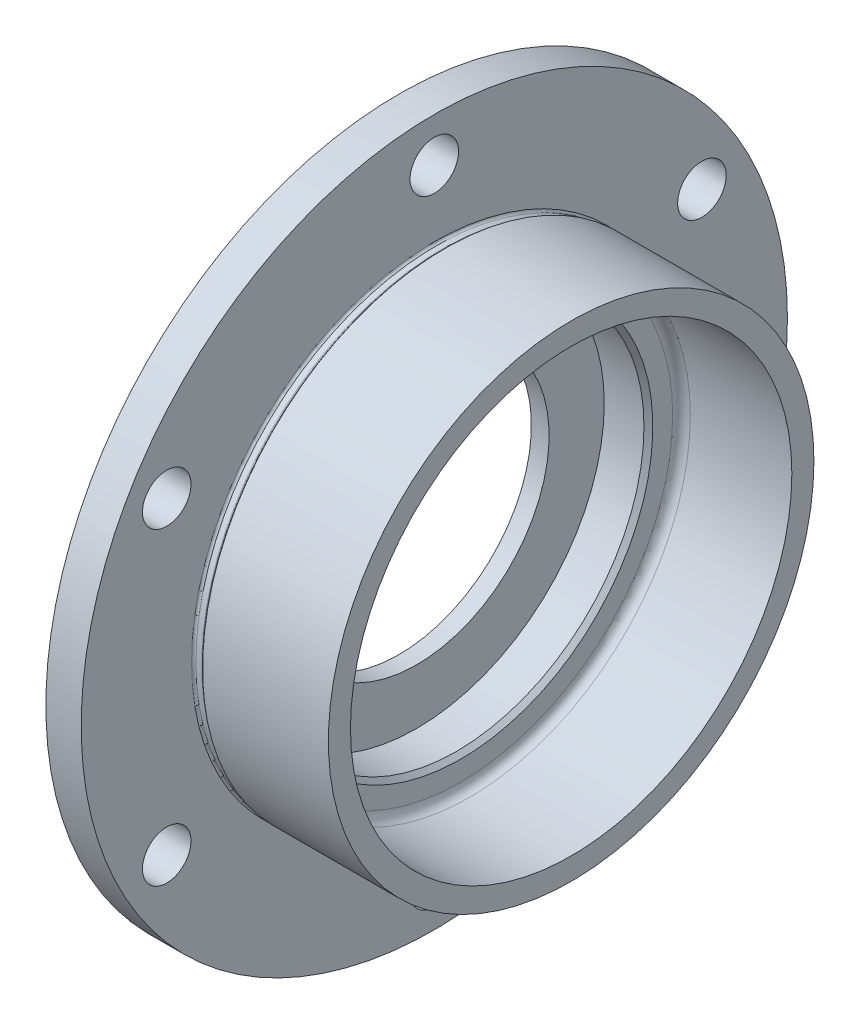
ISO-10303-21;
HEADER;
FILE_DESCRIPTION(('STEP AP214'),'2;1');
FILE_NAME('part.step','',(''),(''),'','','');
FILE_SCHEMA(('AUTOMOTIVE_DESIGN { 1 0 10303 214 1 1 1 1 }'));
ENDSEC;
DATA;
#1=APPLICATION_CONTEXT('core data for automotive mechanical design processes');
#2=APPLICATION_PROTOCOL_DEFINITION('international standard','automotive_design',2000,#1);
#3=PRODUCT_CONTEXT('',#1,'mechanical');
#4=PRODUCT('Part','Part','',(#3));
#5=PRODUCT_RELATED_PRODUCT_CATEGORY('part','',(#4));
#6=PRODUCT_DEFINITION_FORMATION('','',#4);
#7=PRODUCT_DEFINITION_CONTEXT('part definition',#1,'design');
#8=PRODUCT_DEFINITION('design','',#6,#7);
#9=PRODUCT_DEFINITION_SHAPE('','',#8);
#10=(LENGTH_UNIT() NAMED_UNIT(*) SI_UNIT(.MILLI.,.METRE.));
#11=(NAMED_UNIT(*) PLANE_ANGLE_UNIT() SI_UNIT($,.RADIAN.));
#12=(NAMED_UNIT(*) SI_UNIT($,.STERADIAN.) SOLID_ANGLE_UNIT());
#13=UNCERTAINTY_MEASURE_WITH_UNIT(LENGTH_MEASURE(1.E-05),#10,'distance_accuracy_value','');
#14=(GEOMETRIC_REPRESENTATION_CONTEXT(3) GLOBAL_UNCERTAINTY_ASSIGNED_CONTEXT((#13)) GLOBAL_UNIT_ASSIGNED_CONTEXT((#10,
#11,#12)) REPRESENTATION_CONTEXT('',''));
#15=CARTESIAN_POINT('',(0.,0.,0.));
#16=DIRECTION('',(0.,0.,1.));
#17=DIRECTION('',(1.,0.,0.));
#18=AXIS2_PLACEMENT_3D('',#15,#16,#17);
#19=CARTESIAN_POINT('',(4.,0.,0.));
#20=DIRECTION('',(-1.,0.,0.));
#21=DIRECTION('',(0.,0.,1.));
#22=AXIS2_PLACEMENT_3D('',#19,#20,#21);
#23=PLANE('',#22);
#24=CARTESIAN_POINT('',(4.,0.,0.));
#25=DIRECTION('',(-1.,0.,0.));
#26=DIRECTION('',(0.,0.,1.));
#27=AXIS2_PLACEMENT_3D('',#24,#25,#26);
#28=CIRCLE('',#27,30.);
#29=CARTESIAN_POINT('',(4.,0.,30.));
#30=VERTEX_POINT('',#29);
#31=EDGE_CURVE('E119',#30,#30,#28,.F.);
#32=ORIENTED_EDGE('',*,*,#31,.F.);
#33=EDGE_LOOP('',(#32));
#34=FACE_BOUND('',#33,.T.);
#35=CARTESIAN_POINT('',(4.,0.,0.));
#36=DIRECTION('',(1.,0.,0.));
#37=DIRECTION('',(0.,0.,-1.));
#38=AXIS2_PLACEMENT_3D('',#35,#36,#37);
#39=CIRCLE('',#38,42.5);
#40=CARTESIAN_POINT('',(4.,0.,-42.5));
#41=VERTEX_POINT('',#40);
#42=EDGE_CURVE('E65',#41,#41,#39,.T.);
#43=ORIENTED_EDGE('',*,*,#42,.T.);
#44=EDGE_LOOP('',(#43));
#45=FACE_BOUND('',#44,.T.);
#46=ADVANCED_FACE('F33',(#34,#45),#23,.F.);
#47=CARTESIAN_POINT('',(29.9069920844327,0.,0.));
#48=DIRECTION('',(1.,0.,0.));
#49=DIRECTION('',(0.,0.,-1.));
#50=AXIS2_PLACEMENT_3D('',#47,#48,#49);
#51=CYLINDRICAL_SURFACE('',#50,42.5);
#52=CARTESIAN_POINT('',(13.,0.,0.));
#53=DIRECTION('',(-1.,0.,0.));
#54=DIRECTION('',(0.,0.,1.));
#55=AXIS2_PLACEMENT_3D('',#52,#53,#54);
#56=CIRCLE('',#55,42.5);
#57=CARTESIAN_POINT('',(13.,0.,42.5));
#58=VERTEX_POINT('',#57);
#59=EDGE_CURVE('E48',#58,#58,#56,.F.);
#60=ORIENTED_EDGE('',*,*,#59,.T.);
#61=EDGE_LOOP('',(#60));
#62=FACE_BOUND('',#61,.T.);
#63=ORIENTED_EDGE('',*,*,#42,.F.);
#64=EDGE_LOOP('',(#63));
#65=FACE_BOUND('',#64,.T.);
#66=ADVANCED_FACE('F161',(#62,#65),#51,.F.);
#67=CARTESIAN_POINT('',(14.,0.,0.));
#68=DIRECTION('',(-1.,0.,0.));
#69=DIRECTION('',(0.,0.,1.));
#70=AXIS2_PLACEMENT_3D('',#67,#68,#69);
#71=PLANE('',#70);
#72=CARTESIAN_POINT('',(14.,0.,0.));
#73=DIRECTION('',(-1.,0.,0.));
#74=DIRECTION('',(0.,0.,1.));
#75=AXIS2_PLACEMENT_3D('',#72,#73,#74);
#76=CIRCLE('',#75,48.);
#77=CARTESIAN_POINT('',(14.,0.,48.));
#78=VERTEX_POINT('',#77);
#79=EDGE_CURVE('E40',#78,#78,#76,.F.);
#80=ORIENTED_EDGE('',*,*,#79,.T.);
#81=EDGE_LOOP('',(#80));
#82=FACE_BOUND('',#81,.T.);
#83=CARTESIAN_POINT('',(14.,0.,0.));
#84=DIRECTION('',(-1.,0.,0.));
#85=DIRECTION('',(0.,0.,1.));
#86=AXIS2_PLACEMENT_3D('',#83,#84,#85);
#87=CIRCLE('',#86,43.5);
#88=CARTESIAN_POINT('',(14.,0.,43.5));
#89=VERTEX_POINT('',#88);
#90=EDGE_CURVE('E44',#89,#89,#87,.T.);
#91=ORIENTED_EDGE('',*,*,#90,.T.);
#92=EDGE_LOOP('',(#91));
#93=FACE_BOUND('',#92,.T.);
#94=ADVANCED_FACE('F167',(#82,#93),#71,.F.);
#95=CARTESIAN_POINT('',(29.9069920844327,0.,0.));
#96=DIRECTION('',(1.,0.,0.));
#97=DIRECTION('',(0.,0.,-1.));
#98=AXIS2_PLACEMENT_3D('',#95,#96,#97);
#99=CYLINDRICAL_SURFACE('',#98,50.);
#100=CARTESIAN_POINT('',(16.,0.,0.));
#101=DIRECTION('',(-1.,0.,0.));
#102=DIRECTION('',(0.,0.,1.));
#103=AXIS2_PLACEMENT_3D('',#100,#101,#102);
#104=CIRCLE('',#103,50.);
#105=CARTESIAN_POINT('',(16.,0.,50.));
#106=VERTEX_POINT('',#105);
#107=EDGE_CURVE('E10',#106,#106,#104,.T.);
#108=ORIENTED_EDGE('',*,*,#107,.T.);
#109=EDGE_LOOP('',(#108));
#110=FACE_BOUND('',#109,.T.);
#111=CARTESIAN_POINT('',(39.,0.,0.));
#112=DIRECTION('',(1.,0.,0.));
#113=DIRECTION('',(0.,0.,-1.));
#114=AXIS2_PLACEMENT_3D('',#111,#112,#113);
#115=CIRCLE('',#114,50.);
#116=CARTESIAN_POINT('',(39.,0.,-50.));
#117=VERTEX_POINT('',#116);
#118=EDGE_CURVE('E68',#117,#117,#115,.T.);
#119=ORIENTED_EDGE('',*,*,#118,.T.);
#120=EDGE_LOOP('',(#119));
#121=FACE_BOUND('',#120,.T.);
#122=ADVANCED_FACE('F198',(#110,#121),#99,.F.);
#123=CARTESIAN_POINT('',(39.,0.,0.));
#124=DIRECTION('',(-1.,0.,0.));
#125=DIRECTION('',(0.,0.,1.));
#126=AXIS2_PLACEMENT_3D('',#123,#124,#125);
#127=PLANE('',#126);
#128=ORIENTED_EDGE('',*,*,#118,.F.);
#129=EDGE_LOOP('',(#128));
#130=FACE_BOUND('',#129,.T.);
#131=CARTESIAN_POINT('',(39.,0.,0.));
#132=DIRECTION('',(1.,0.,0.));
#133=DIRECTION('',(0.,0.,-1.));
#134=AXIS2_PLACEMENT_3D('',#131,#132,#133);
#135=CIRCLE('',#134,55.);
#136=CARTESIAN_POINT('',(39.,0.,-55.));
#137=VERTEX_POINT('',#136);
#138=EDGE_CURVE('E71',#137,#137,#135,.T.);
#139=ORIENTED_EDGE('',*,*,#138,.T.);
#140=EDGE_LOOP('',(#139));
#141=FACE_BOUND('',#140,.T.);
#142=ADVANCED_FACE('F202',(#130,#141),#127,.F.);
#143=CARTESIAN_POINT('',(29.9069920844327,0.,0.));
#144=DIRECTION('',(1.,0.,0.));
#145=DIRECTION('',(0.,0.,-1.));
#146=AXIS2_PLACEMENT_3D('',#143,#144,#145);
#147=CYLINDRICAL_SURFACE('',#146,55.);
#148=CARTESIAN_POINT('',(10.5,0.,0.));
#149=DIRECTION('',(1.,0.,0.));
#150=DIRECTION('',(0.,0.,-1.));
#151=AXIS2_PLACEMENT_3D('',#148,#149,#150);
#152=CIRCLE('',#151,55.);
#153=CARTESIAN_POINT('',(10.5,0.,-55.));
#154=VERTEX_POINT('',#153);
#155=EDGE_CURVE('E80',#154,#154,#152,.T.);
#156=ORIENTED_EDGE('',*,*,#155,.T.);
#157=EDGE_LOOP('',(#156));
#158=FACE_BOUND('',#157,.T.);
#159=ORIENTED_EDGE('',*,*,#138,.F.);
#160=EDGE_LOOP('',(#159));
#161=FACE_BOUND('',#160,.T.);
#162=ADVANCED_FACE('F207',(#158,#161),#147,.T.);
#163=CARTESIAN_POINT('',(36.050630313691,0.,0.));
#164=DIRECTION('',(1.,0.,0.));
#165=DIRECTION('',(0.,0.,-1.));
#166=AXIS2_PLACEMENT_3D('',#163,#164,#165);
#167=CYLINDRICAL_SURFACE('',#166,54.5);
#168=CARTESIAN_POINT('',(8.5,0.,0.));
#169=DIRECTION('',(-1.,0.,0.));
#170=DIRECTION('',(0.,0.,1.));
#171=AXIS2_PLACEMENT_3D('',#168,#169,#170);
#172=CIRCLE('',#171,54.5);
#173=CARTESIAN_POINT('',(8.5,0.,54.5));
#174=VERTEX_POINT('',#173);
#175=EDGE_CURVE('E59',#174,#174,#172,.F.);
#176=ORIENTED_EDGE('',*,*,#175,.T.);
#177=EDGE_LOOP('',(#176));
#178=FACE_BOUND('',#177,.T.);
#179=CARTESIAN_POINT('',(9.79289321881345,0.,0.));
#180=DIRECTION('',(1.,0.,0.));
#181=DIRECTION('',(0.,0.,-1.));
#182=AXIS2_PLACEMENT_3D('',#179,#180,#181);
#183=CIRCLE('',#182,54.5);
#184=CARTESIAN_POINT('',(9.79289321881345,0.,-54.5));
#185=VERTEX_POINT('',#184);
#186=EDGE_CURVE('E62',#185,#185,#183,.F.);
#187=ORIENTED_EDGE('',*,*,#186,.T.);
#188=EDGE_LOOP('',(#187));
#189=FACE_BOUND('',#188,.T.);
#190=ADVANCED_FACE('F210',(#178,#189),#167,.T.);
#191=CARTESIAN_POINT('',(10.,0.,0.));
#192=DIRECTION('',(1.,0.,0.));
#193=DIRECTION('',(0.,0.,-1.));
#194=AXIS2_PLACEMENT_3D('',#191,#192,#193);
#195=CONICAL_SURFACE('',#194,54.5,0.785398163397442);
#196=CARTESIAN_POINT('',(10.1464466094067,0.,0.));
#197=DIRECTION('',(1.,0.,0.));
#198=DIRECTION('',(0.,0.,-1.));
#199=AXIS2_PLACEMENT_3D('',#196,#197,#198);
#200=CIRCLE('',#199,54.6464466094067);
#201=CARTESIAN_POINT('',(10.1464466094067,0.,-54.6464466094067));
#202=VERTEX_POINT('',#201);
#203=EDGE_CURVE('E53',#202,#202,#200,.T.);
#204=ORIENTED_EDGE('',*,*,#203,.T.);
#205=EDGE_LOOP('',(#204));
#206=FACE_BOUND('',#205,.T.);
#207=ORIENTED_EDGE('',*,*,#155,.F.);
#208=EDGE_LOOP('',(#207));
#209=FACE_BOUND('',#208,.T.);
#210=ADVANCED_FACE('F133',(#206,#209),#195,.T.);
#211=CARTESIAN_POINT('',(0.,0.,0.));
#212=DIRECTION('',(1.,0.,0.));
#213=DIRECTION('',(0.,0.,-1.));
#214=AXIS2_PLACEMENT_3D('',#211,#212,#213);
#215=PLANE('',#214);
#216=CARTESIAN_POINT('',(0.,0.,0.));
#217=DIRECTION('',(-1.,0.,0.));
#218=DIRECTION('',(0.,0.,1.));
#219=AXIS2_PLACEMENT_3D('',#216,#217,#218);
#220=CIRCLE('',#219,30.);
#221=CARTESIAN_POINT('',(0.,0.,30.));
#222=VERTEX_POINT('',#221);
#223=EDGE_CURVE('E122',#222,#222,#220,.T.);
#224=ORIENTED_EDGE('',*,*,#223,.F.);
#225=EDGE_LOOP('',(#224));
#226=FACE_BOUND('',#225,.T.);
#227=CARTESIAN_POINT('',(0.,35.0000000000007,-60.6217782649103));
#228=DIRECTION('',(-1.,0.,0.));
#229=DIRECTION('',(0.,0.866025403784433,0.50000000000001));
#230=AXIS2_PLACEMENT_3D('',#227,#228,#229);
#231=CIRCLE('',#230,5.5);
#232=CARTESIAN_POINT('',(0.,39.7631397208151,-57.8717782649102));
#233=VERTEX_POINT('',#232);
#234=EDGE_CURVE('E116',#233,#233,#231,.T.);
#235=ORIENTED_EDGE('',*,*,#234,.F.);
#236=EDGE_LOOP('',(#235));
#237=FACE_BOUND('',#236,.T.);
#238=CARTESIAN_POINT('',(0.,-34.9999999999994,-60.621778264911));
#239=DIRECTION('',(-1.,0.,0.));
#240=DIRECTION('',(0.,0.866025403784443,-0.499999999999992));
#241=AXIS2_PLACEMENT_3D('',#238,#239,#240);
#242=CIRCLE('',#241,5.5);
#243=CARTESIAN_POINT('',(0.,-30.236860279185,-63.371778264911));
#244=VERTEX_POINT('',#243);
#245=EDGE_CURVE('E110',#244,#244,#242,.T.);
#246=ORIENTED_EDGE('',*,*,#245,.F.);
#247=EDGE_LOOP('',(#246));
#248=FACE_BOUND('',#247,.T.);
#249=CARTESIAN_POINT('',(0.,-70.,-4.88807387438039E-13));
#250=DIRECTION('',(-1.,0.,0.));
#251=DIRECTION('',(0.,0.,-1.));
#252=AXIS2_PLACEMENT_3D('',#249,#250,#251);
#253=CIRCLE('',#252,5.5);
#254=CARTESIAN_POINT('',(0.,-70.,-5.50000000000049));
#255=VERTEX_POINT('',#254);
#256=EDGE_CURVE('E104',#255,#255,#253,.T.);
#257=ORIENTED_EDGE('',*,*,#256,.F.);
#258=EDGE_LOOP('',(#257));
#259=FACE_BOUND('',#258,.T.);
#260=CARTESIAN_POINT('',(0.,-35.0000000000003,60.6217782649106));
#261=DIRECTION('',(-1.,0.,0.));
#262=DIRECTION('',(0.,-0.866025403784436,-0.500000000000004));
#263=AXIS2_PLACEMENT_3D('',#260,#261,#262);
#264=CIRCLE('',#263,5.5);
#265=CARTESIAN_POINT('',(0.,-39.7631397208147,57.8717782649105));
#266=VERTEX_POINT('',#265);
#267=EDGE_CURVE('E98',#266,#266,#264,.T.);
#268=ORIENTED_EDGE('',*,*,#267,.F.);
#269=EDGE_LOOP('',(#268));
#270=FACE_BOUND('',#269,.T.);
#271=CARTESIAN_POINT('',(0.,34.9999999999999,60.6217782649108));
#272=DIRECTION('',(-1.,0.,0.));
#273=DIRECTION('',(0.,-0.86602540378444,0.499999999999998));
#274=AXIS2_PLACEMENT_3D('',#271,#272,#273);
#275=CIRCLE('',#274,5.5);
#276=CARTESIAN_POINT('',(0.,30.2368602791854,63.3717782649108));
#277=VERTEX_POINT('',#276);
#278=EDGE_CURVE('E92',#277,#277,#275,.T.);
#279=ORIENTED_EDGE('',*,*,#278,.F.);
#280=EDGE_LOOP('',(#279));
#281=FACE_BOUND('',#280,.T.);
#282=CARTESIAN_POINT('',(0.,70.,0.));
#283=DIRECTION('',(-1.,0.,0.));
#284=DIRECTION('',(0.,0.,1.));
#285=AXIS2_PLACEMENT_3D('',#282,#283,#284);
#286=CIRCLE('',#285,5.5);
#287=CARTESIAN_POINT('',(0.,70.,5.5));
#288=VERTEX_POINT('',#287);
#289=EDGE_CURVE('E86',#288,#288,#286,.T.);
#290=ORIENTED_EDGE('',*,*,#289,.F.);
#291=EDGE_LOOP('',(#290));
#292=FACE_BOUND('',#291,.T.);
#293=CARTESIAN_POINT('',(0.,0.,0.));
#294=DIRECTION('',(1.,0.,0.));
#295=DIRECTION('',(0.,0.,-1.));
#296=AXIS2_PLACEMENT_3D('',#293,#294,#295);
#297=CIRCLE('',#296,80.);
#298=CARTESIAN_POINT('',(0.,0.,-80.));
#299=VERTEX_POINT('',#298);
#300=EDGE_CURVE('E77',#299,#299,#297,.T.);
#301=ORIENTED_EDGE('',*,*,#300,.F.);
#302=EDGE_LOOP('',(#301));
#303=FACE_BOUND('',#302,.T.);
#304=ADVANCED_FACE('F129',(#226,#237,#248,#259,#270,#281,#292,#303),#215,.F.);
#305=CARTESIAN_POINT('',(29.9069920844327,0.,0.));
#306=DIRECTION('',(1.,0.,0.));
#307=DIRECTION('',(0.,0.,-1.));
#308=AXIS2_PLACEMENT_3D('',#305,#306,#307);
#309=CYLINDRICAL_SURFACE('',#308,80.);
#310=CARTESIAN_POINT('',(8.,0.,0.));
#311=DIRECTION('',(1.,0.,0.));
#312=DIRECTION('',(0.,0.,-1.));
#313=AXIS2_PLACEMENT_3D('',#310,#311,#312);
#314=CIRCLE('',#313,80.);
#315=CARTESIAN_POINT('',(8.,0.,-80.));
#316=VERTEX_POINT('',#315);
#317=EDGE_CURVE('E74',#316,#316,#314,.T.);
#318=ORIENTED_EDGE('',*,*,#317,.F.);
#319=EDGE_LOOP('',(#318));
#320=FACE_BOUND('',#319,.T.);
#321=ORIENTED_EDGE('',*,*,#300,.T.);
#322=EDGE_LOOP('',(#321));
#323=FACE_BOUND('',#322,.T.);
#324=ADVANCED_FACE('F132',(#320,#323),#309,.T.);
#325=CARTESIAN_POINT('',(8.,0.,0.));
#326=DIRECTION('',(-1.,0.,0.));
#327=DIRECTION('',(0.,0.,1.));
#328=AXIS2_PLACEMENT_3D('',#325,#326,#327);
#329=PLANE('',#328);
#330=CARTESIAN_POINT('',(8.,35.0000000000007,-60.6217782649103));
#331=DIRECTION('',(-1.,0.,0.));
#332=DIRECTION('',(0.,0.,1.));
#333=AXIS2_PLACEMENT_3D('',#330,#331,#332);
#334=CIRCLE('',#333,5.5);
#335=CARTESIAN_POINT('',(8.,35.0000000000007,-55.1217782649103));
#336=VERTEX_POINT('',#335);
#337=EDGE_CURVE('E113',#336,#336,#334,.F.);
#338=ORIENTED_EDGE('',*,*,#337,.F.);
#339=EDGE_LOOP('',(#338));
#340=FACE_BOUND('',#339,.T.);
#341=CARTESIAN_POINT('',(8.,-34.9999999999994,-60.621778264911));
#342=DIRECTION('',(-1.,0.,0.));
#343=DIRECTION('',(0.,0.,1.));
#344=AXIS2_PLACEMENT_3D('',#341,#342,#343);
#345=CIRCLE('',#344,5.5);
#346=CARTESIAN_POINT('',(8.,-34.9999999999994,-55.121778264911));
#347=VERTEX_POINT('',#346);
#348=EDGE_CURVE('E107',#347,#347,#345,.F.);
#349=ORIENTED_EDGE('',*,*,#348,.F.);
#350=EDGE_LOOP('',(#349));
#351=FACE_BOUND('',#350,.T.);
#352=CARTESIAN_POINT('',(8.,-70.,-4.88807387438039E-13));
#353=DIRECTION('',(-1.,0.,0.));
#354=DIRECTION('',(0.,0.,1.));
#355=AXIS2_PLACEMENT_3D('',#352,#353,#354);
#356=CIRCLE('',#355,5.5);
#357=CARTESIAN_POINT('',(8.,-70.,5.49999999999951));
#358=VERTEX_POINT('',#357);
#359=EDGE_CURVE('E101',#358,#358,#356,.F.);
#360=ORIENTED_EDGE('',*,*,#359,.F.);
#361=EDGE_LOOP('',(#360));
#362=FACE_BOUND('',#361,.T.);
#363=CARTESIAN_POINT('',(8.,-35.0000000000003,60.6217782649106));
#364=DIRECTION('',(-1.,0.,0.));
#365=DIRECTION('',(0.,0.,1.));
#366=AXIS2_PLACEMENT_3D('',#363,#364,#365);
#367=CIRCLE('',#366,5.5);
#368=CARTESIAN_POINT('',(8.,-35.0000000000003,66.1217782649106));
#369=VERTEX_POINT('',#368);
#370=EDGE_CURVE('E95',#369,#369,#367,.F.);
#371=ORIENTED_EDGE('',*,*,#370,.F.);
#372=EDGE_LOOP('',(#371));
#373=FACE_BOUND('',#372,.T.);
#374=CARTESIAN_POINT('',(8.,34.9999999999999,60.6217782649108));
#375=DIRECTION('',(-1.,0.,0.));
#376=DIRECTION('',(0.,0.,1.));
#377=AXIS2_PLACEMENT_3D('',#374,#375,#376);
#378=CIRCLE('',#377,5.5);
#379=CARTESIAN_POINT('',(8.,34.9999999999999,66.1217782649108));
#380=VERTEX_POINT('',#379);
#381=EDGE_CURVE('E89',#380,#380,#378,.F.);
#382=ORIENTED_EDGE('',*,*,#381,.F.);
#383=EDGE_LOOP('',(#382));
#384=FACE_BOUND('',#383,.T.);
#385=CARTESIAN_POINT('',(8.,70.,0.));
#386=DIRECTION('',(-1.,0.,0.));
#387=DIRECTION('',(0.,0.,1.));
#388=AXIS2_PLACEMENT_3D('',#385,#386,#387);
#389=CIRCLE('',#388,5.5);
#390=CARTESIAN_POINT('',(8.,70.,5.5));
#391=VERTEX_POINT('',#390);
#392=EDGE_CURVE('E83',#391,#391,#389,.F.);
#393=ORIENTED_EDGE('',*,*,#392,.F.);
#394=EDGE_LOOP('',(#393));
#395=FACE_BOUND('',#394,.T.);
#396=CARTESIAN_POINT('',(8.,0.,0.));
#397=DIRECTION('',(-1.,0.,0.));
#398=DIRECTION('',(0.,0.,1.));
#399=AXIS2_PLACEMENT_3D('',#396,#397,#398);
#400=CIRCLE('',#399,55.);
#401=CARTESIAN_POINT('',(8.,0.,55.));
#402=VERTEX_POINT('',#401);
#403=EDGE_CURVE('E56',#402,#402,#400,.T.);
#404=ORIENTED_EDGE('',*,*,#403,.T.);
#405=EDGE_LOOP('',(#404));
#406=FACE_BOUND('',#405,.T.);
#407=ORIENTED_EDGE('',*,*,#317,.T.);
#408=EDGE_LOOP('',(#407));
#409=FACE_BOUND('',#408,.T.);
#410=ADVANCED_FACE('F150',(#340,#351,#362,#373,#384,#395,#406,#409),#329,.F.);
#411=CARTESIAN_POINT('',(8.5,0.,0.));
#412=DIRECTION('',(-1.,0.,0.));
#413=DIRECTION('',(0.,0.,1.));
#414=AXIS2_PLACEMENT_3D('',#411,#412,#413);
#415=TOROIDAL_SURFACE('',#414,55.,0.5);
#416=ORIENTED_EDGE('',*,*,#403,.F.);
#417=EDGE_LOOP('',(#416));
#418=FACE_BOUND('',#417,.T.);
#419=ORIENTED_EDGE('',*,*,#175,.F.);
#420=EDGE_LOOP('',(#419));
#421=FACE_BOUND('',#420,.T.);
#422=ADVANCED_FACE('F156',(#418,#421),#415,.F.);
#423=CARTESIAN_POINT('',(9.79289321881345,0.,0.));
#424=DIRECTION('',(1.,0.,0.));
#425=DIRECTION('',(0.,0.,-1.));
#426=AXIS2_PLACEMENT_3D('',#423,#424,#425);
#427=TOROIDAL_SURFACE('',#426,55.,0.5);
#428=ORIENTED_EDGE('',*,*,#186,.F.);
#429=EDGE_LOOP('',(#428));
#430=FACE_BOUND('',#429,.T.);
#431=ORIENTED_EDGE('',*,*,#203,.F.);
#432=EDGE_LOOP('',(#431));
#433=FACE_BOUND('',#432,.T.);
#434=ADVANCED_FACE('F176',(#430,#433),#427,.F.);
#435=CARTESIAN_POINT('',(39.001,70.,0.));
#436=DIRECTION('',(-1.,0.,0.));
#437=DIRECTION('',(0.,0.,1.));
#438=AXIS2_PLACEMENT_3D('',#435,#436,#437);
#439=CYLINDRICAL_SURFACE('',#438,5.5);
#440=ORIENTED_EDGE('',*,*,#289,.T.);
#441=EDGE_LOOP('',(#440));
#442=FACE_BOUND('',#441,.T.);
#443=ORIENTED_EDGE('',*,*,#392,.T.);
#444=EDGE_LOOP('',(#443));
#445=FACE_BOUND('',#444,.T.);
#446=ADVANCED_FACE('F179',(#442,#445),#439,.F.);
#447=CARTESIAN_POINT('',(39.001,34.9999999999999,60.6217782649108));
#448=DIRECTION('',(-1.,0.,0.));
#449=DIRECTION('',(0.,0.,1.));
#450=AXIS2_PLACEMENT_3D('',#447,#448,#449);
#451=CYLINDRICAL_SURFACE('',#450,5.5);
#452=ORIENTED_EDGE('',*,*,#278,.T.);
#453=EDGE_LOOP('',(#452));
#454=FACE_BOUND('',#453,.T.);
#455=ORIENTED_EDGE('',*,*,#381,.T.);
#456=EDGE_LOOP('',(#455));
#457=FACE_BOUND('',#456,.T.);
#458=ADVANCED_FACE('F230',(#454,#457),#451,.F.);
#459=CARTESIAN_POINT('',(39.001,-35.0000000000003,60.6217782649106));
#460=DIRECTION('',(-1.,0.,0.));
#461=DIRECTION('',(0.,0.,1.));
#462=AXIS2_PLACEMENT_3D('',#459,#460,#461);
#463=CYLINDRICAL_SURFACE('',#462,5.5);
#464=ORIENTED_EDGE('',*,*,#267,.T.);
#465=EDGE_LOOP('',(#464));
#466=FACE_BOUND('',#465,.T.);
#467=ORIENTED_EDGE('',*,*,#370,.T.);
#468=EDGE_LOOP('',(#467));
#469=FACE_BOUND('',#468,.T.);
#470=ADVANCED_FACE('F234',(#466,#469),#463,.F.);
#471=CARTESIAN_POINT('',(39.001,-70.,-4.88807387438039E-13));
#472=DIRECTION('',(-1.,0.,0.));
#473=DIRECTION('',(0.,0.,1.));
#474=AXIS2_PLACEMENT_3D('',#471,#472,#473);
#475=CYLINDRICAL_SURFACE('',#474,5.5);
#476=ORIENTED_EDGE('',*,*,#256,.T.);
#477=EDGE_LOOP('',(#476));
#478=FACE_BOUND('',#477,.T.);
#479=ORIENTED_EDGE('',*,*,#359,.T.);
#480=EDGE_LOOP('',(#479));
#481=FACE_BOUND('',#480,.T.);
#482=ADVANCED_FACE('F238',(#478,#481),#475,.F.);
#483=CARTESIAN_POINT('',(39.001,-34.9999999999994,-60.621778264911));
#484=DIRECTION('',(-1.,0.,0.));
#485=DIRECTION('',(0.,0.,1.));
#486=AXIS2_PLACEMENT_3D('',#483,#484,#485);
#487=CYLINDRICAL_SURFACE('',#486,5.5);
#488=ORIENTED_EDGE('',*,*,#245,.T.);
#489=EDGE_LOOP('',(#488));
#490=FACE_BOUND('',#489,.T.);
#491=ORIENTED_EDGE('',*,*,#348,.T.);
#492=EDGE_LOOP('',(#491));
#493=FACE_BOUND('',#492,.T.);
#494=ADVANCED_FACE('F242',(#490,#493),#487,.F.);
#495=CARTESIAN_POINT('',(39.001,35.0000000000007,-60.6217782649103));
#496=DIRECTION('',(-1.,0.,0.));
#497=DIRECTION('',(0.,0.,1.));
#498=AXIS2_PLACEMENT_3D('',#495,#496,#497);
#499=CYLINDRICAL_SURFACE('',#498,5.5);
#500=ORIENTED_EDGE('',*,*,#234,.T.);
#501=EDGE_LOOP('',(#500));
#502=FACE_BOUND('',#501,.T.);
#503=ORIENTED_EDGE('',*,*,#337,.T.);
#504=EDGE_LOOP('',(#503));
#505=FACE_BOUND('',#504,.T.);
#506=ADVANCED_FACE('F189',(#502,#505),#499,.F.);
#507=CARTESIAN_POINT('',(39.001,0.,0.));
#508=DIRECTION('',(-1.,0.,0.));
#509=DIRECTION('',(0.,0.,1.));
#510=AXIS2_PLACEMENT_3D('',#507,#508,#509);
#511=CYLINDRICAL_SURFACE('',#510,30.);
#512=ORIENTED_EDGE('',*,*,#223,.T.);
#513=EDGE_LOOP('',(#512));
#514=FACE_BOUND('',#513,.T.);
#515=ORIENTED_EDGE('',*,*,#31,.T.);
#516=EDGE_LOOP('',(#515));
#517=FACE_BOUND('',#516,.T.);
#518=ADVANCED_FACE('F126',(#514,#517),#511,.F.);
#519=CARTESIAN_POINT('',(13.,0.,0.));
#520=DIRECTION('',(1.,0.,0.));
#521=DIRECTION('',(0.,0.,-1.));
#522=AXIS2_PLACEMENT_3D('',#519,#520,#521);
#523=CONICAL_SURFACE('',#522,42.5,0.785398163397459);
#524=ORIENTED_EDGE('',*,*,#90,.F.);
#525=EDGE_LOOP('',(#524));
#526=FACE_BOUND('',#525,.T.);
#527=ORIENTED_EDGE('',*,*,#59,.F.);
#528=EDGE_LOOP('',(#527));
#529=FACE_BOUND('',#528,.T.);
#530=ADVANCED_FACE('F181',(#526,#529),#523,.F.);
#531=CARTESIAN_POINT('',(16.,0.,0.));
#532=DIRECTION('',(-1.,0.,0.));
#533=DIRECTION('',(0.,0.,1.));
#534=AXIS2_PLACEMENT_3D('',#531,#532,#533);
#535=TOROIDAL_SURFACE('',#534,48.,2.);
#536=ORIENTED_EDGE('',*,*,#107,.F.);
#537=EDGE_LOOP('',(#536));
#538=FACE_BOUND('',#537,.T.);
#539=ORIENTED_EDGE('',*,*,#79,.F.);
#540=EDGE_LOOP('',(#539));
#541=FACE_BOUND('',#540,.T.);
#542=ADVANCED_FACE('F35',(#538,#541),#535,.F.);
#543=CLOSED_SHELL('',(#46,#66,#94,#122,#142,#162,#190,#210,#304,#324,#410,#422,#434,#446,#458,
#470,#482,#494,#506,#518,#530,#542));
#544=MANIFOLD_SOLID_BREP('B2',#543);
#545=ADVANCED_BREP_SHAPE_REPRESENTATION('',(#18,#544),#14);
#546=SHAPE_DEFINITION_REPRESENTATION(#9,#545);
ENDSEC;
END-ISO-10303-21;
